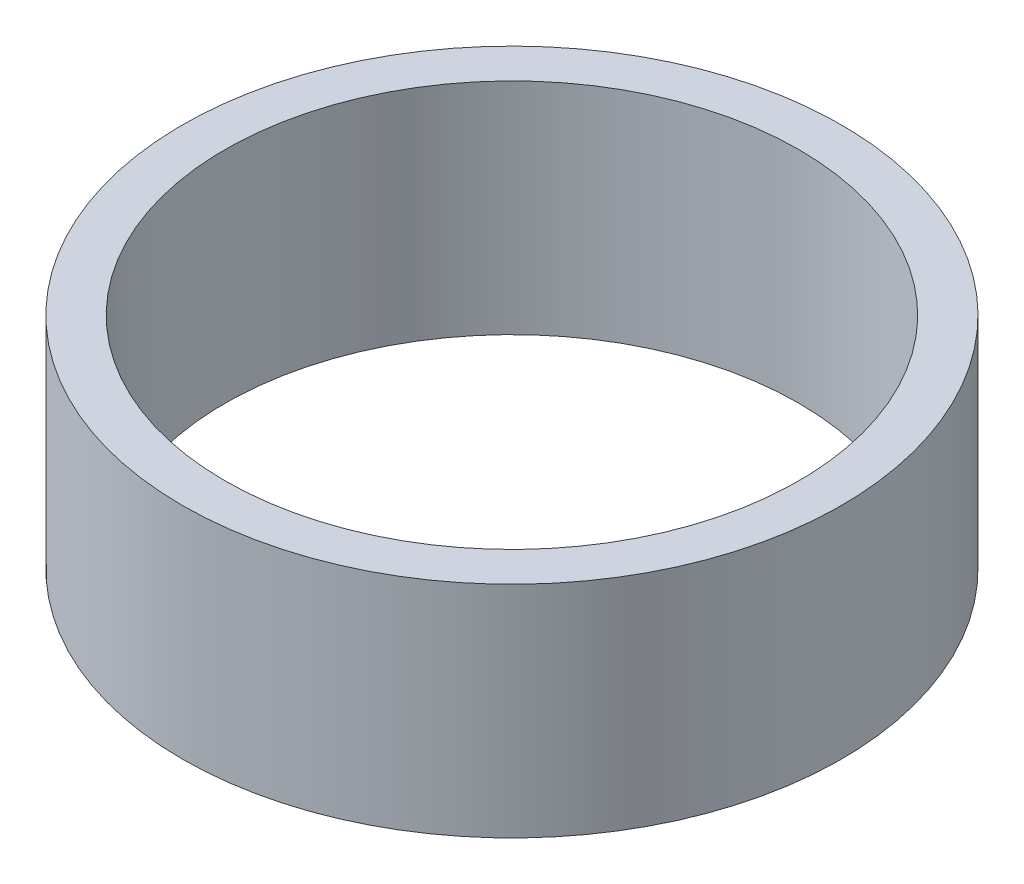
ISO-10303-21;
HEADER;
FILE_DESCRIPTION(('STEP AP214'),'2;1');
FILE_NAME('part.step','',(''),(''),'','','');
FILE_SCHEMA(('AUTOMOTIVE_DESIGN { 1 0 10303 214 1 1 1 1 }'));
ENDSEC;
DATA;
#1=APPLICATION_CONTEXT('core data for automotive mechanical design processes');
#2=APPLICATION_PROTOCOL_DEFINITION('international standard','automotive_design',2000,#1);
#3=PRODUCT_CONTEXT('',#1,'mechanical');
#4=PRODUCT('Part','Part','',(#3));
#5=PRODUCT_RELATED_PRODUCT_CATEGORY('part','',(#4));
#6=PRODUCT_DEFINITION_FORMATION('','',#4);
#7=PRODUCT_DEFINITION_CONTEXT('part definition',#1,'design');
#8=PRODUCT_DEFINITION('design','',#6,#7);
#9=PRODUCT_DEFINITION_SHAPE('','',#8);
#10=(LENGTH_UNIT() NAMED_UNIT(*) SI_UNIT(.MILLI.,.METRE.));
#11=(NAMED_UNIT(*) PLANE_ANGLE_UNIT() SI_UNIT($,.RADIAN.));
#12=(NAMED_UNIT(*) SI_UNIT($,.STERADIAN.) SOLID_ANGLE_UNIT());
#13=UNCERTAINTY_MEASURE_WITH_UNIT(LENGTH_MEASURE(1.E-05),#10,'distance_accuracy_value','');
#14=(GEOMETRIC_REPRESENTATION_CONTEXT(3) GLOBAL_UNCERTAINTY_ASSIGNED_CONTEXT((#13)) GLOBAL_UNIT_ASSIGNED_CONTEXT((#10,
#11,#12)) REPRESENTATION_CONTEXT('',''));
#15=CARTESIAN_POINT('',(0.,0.,0.));
#16=DIRECTION('',(0.,0.,1.));
#17=DIRECTION('',(1.,0.,0.));
#18=AXIS2_PLACEMENT_3D('',#15,#16,#17);
#19=CARTESIAN_POINT('',(0.,4.75505862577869,0.));
#20=DIRECTION('',(0.,1.,0.));
#21=DIRECTION('',(0.,0.,1.));
#22=AXIS2_PLACEMENT_3D('',#19,#20,#21);
#23=CYLINDRICAL_SURFACE('',#22,12.75);
#24=CARTESIAN_POINT('',(0.,0.,0.));
#25=DIRECTION('',(0.,1.,0.));
#26=DIRECTION('',(0.,0.,1.));
#27=AXIS2_PLACEMENT_3D('',#24,#25,#26);
#28=CIRCLE('',#27,12.75);
#29=CARTESIAN_POINT('',(0.,0.,12.75));
#30=VERTEX_POINT('',#29);
#31=EDGE_CURVE('E10',#30,#30,#28,.T.);
#32=ORIENTED_EDGE('',*,*,#31,.F.);
#33=EDGE_LOOP('',(#32));
#34=FACE_BOUND('',#33,.T.);
#35=CARTESIAN_POINT('',(0.,-8.5,0.));
#36=DIRECTION('',(0.,1.,0.));
#37=DIRECTION('',(0.,0.,1.));
#38=AXIS2_PLACEMENT_3D('',#35,#36,#37);
#39=CIRCLE('',#38,12.75);
#40=CARTESIAN_POINT('',(0.,-8.5,12.75));
#41=VERTEX_POINT('',#40);
#42=EDGE_CURVE('E45',#41,#41,#39,.T.);
#43=ORIENTED_EDGE('',*,*,#42,.T.);
#44=EDGE_LOOP('',(#43));
#45=FACE_BOUND('',#44,.T.);
#46=ADVANCED_FACE('F31',(#34,#45),#23,.T.);
#47=CARTESIAN_POINT('',(0.,0.,-11.1));
#48=DIRECTION('',(0.,-1.,0.));
#49=DIRECTION('',(0.,0.,-1.));
#50=AXIS2_PLACEMENT_3D('',#47,#48,#49);
#51=PLANE('',#50);
#52=CARTESIAN_POINT('',(0.,0.,0.));
#53=DIRECTION('',(0.,1.,0.));
#54=DIRECTION('',(0.,0.,1.));
#55=AXIS2_PLACEMENT_3D('',#52,#53,#54);
#56=CIRCLE('',#55,11.1);
#57=CARTESIAN_POINT('',(0.,0.,11.1));
#58=VERTEX_POINT('',#57);
#59=EDGE_CURVE('E37',#58,#58,#56,.T.);
#60=ORIENTED_EDGE('',*,*,#59,.F.);
#61=EDGE_LOOP('',(#60));
#62=FACE_BOUND('',#61,.T.);
#63=ORIENTED_EDGE('',*,*,#31,.T.);
#64=EDGE_LOOP('',(#63));
#65=FACE_BOUND('',#64,.T.);
#66=ADVANCED_FACE('F60',(#62,#65),#51,.F.);
#67=CARTESIAN_POINT('',(0.,4.75505862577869,0.));
#68=DIRECTION('',(0.,1.,0.));
#69=DIRECTION('',(0.,0.,1.));
#70=AXIS2_PLACEMENT_3D('',#67,#68,#69);
#71=CYLINDRICAL_SURFACE('',#70,11.1);
#72=CARTESIAN_POINT('',(0.,-8.5,0.));
#73=DIRECTION('',(0.,1.,0.));
#74=DIRECTION('',(0.,0.,1.));
#75=AXIS2_PLACEMENT_3D('',#72,#73,#74);
#76=CIRCLE('',#75,11.1);
#77=CARTESIAN_POINT('',(0.,-8.5,11.1));
#78=VERTEX_POINT('',#77);
#79=EDGE_CURVE('E41',#78,#78,#76,.T.);
#80=ORIENTED_EDGE('',*,*,#79,.F.);
#81=EDGE_LOOP('',(#80));
#82=FACE_BOUND('',#81,.T.);
#83=ORIENTED_EDGE('',*,*,#59,.T.);
#84=EDGE_LOOP('',(#83));
#85=FACE_BOUND('',#84,.T.);
#86=ADVANCED_FACE('F55',(#82,#85),#71,.F.);
#87=CARTESIAN_POINT('',(0.,-8.5,-11.1));
#88=DIRECTION('',(0.,1.,0.));
#89=DIRECTION('',(0.,0.,1.));
#90=AXIS2_PLACEMENT_3D('',#87,#88,#89);
#91=PLANE('',#90);
#92=ORIENTED_EDGE('',*,*,#42,.F.);
#93=EDGE_LOOP('',(#92));
#94=FACE_BOUND('',#93,.T.);
#95=ORIENTED_EDGE('',*,*,#79,.T.);
#96=EDGE_LOOP('',(#95));
#97=FACE_BOUND('',#96,.T.);
#98=ADVANCED_FACE('F52',(#94,#97),#91,.F.);
#99=CLOSED_SHELL('',(#46,#66,#86,#98));
#100=MANIFOLD_SOLID_BREP('B2',#99);
#101=ADVANCED_BREP_SHAPE_REPRESENTATION('',(#18,#100),#14);
#102=SHAPE_DEFINITION_REPRESENTATION(#9,#101);
ENDSEC;
END-ISO-10303-21;
